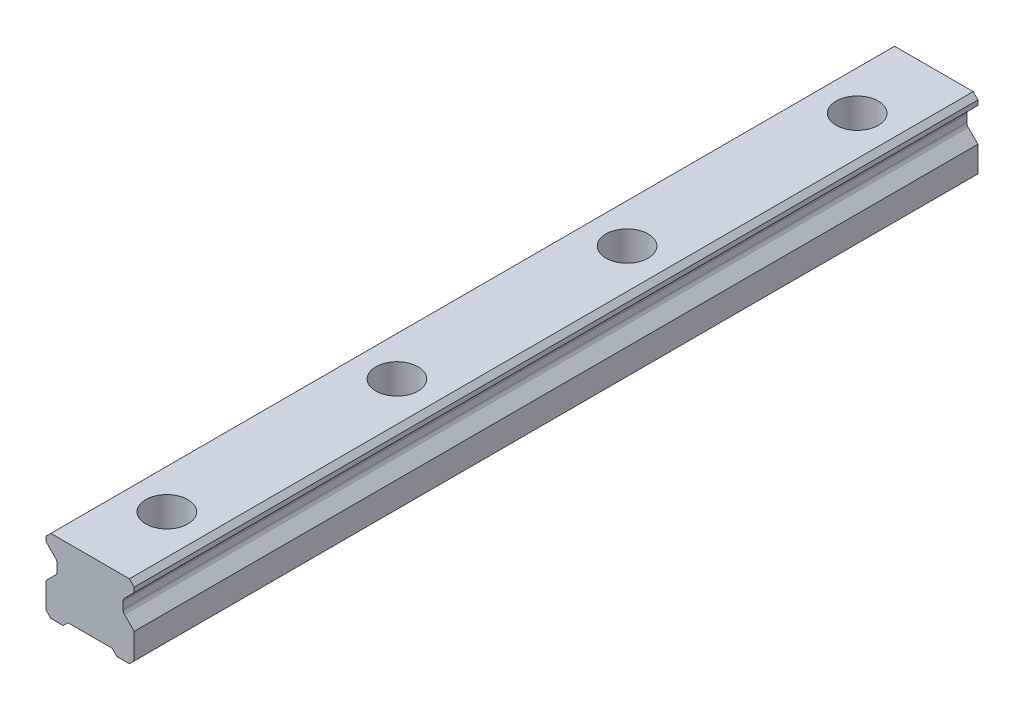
from build123d import *

# Parameters (mm, degrees)
SKETCH1_W           = 23
SKETCH1_H           = 19.2
BOSS_EXTRUDE1_DEPTH = 110
CUT_EXTRUDE1_DEPTH  = 222.135456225
CHAMFER1_SIZE       = 1.25
FILLET1_R           = 1.25
CUT_EXTRUDE2_DEPTH  = 222.135456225
SKETCH4_R           = 5.5
SKETCH4_R_2         = 3.5
CUT_EXTRUDE3_DEPTH  = 9
SKETCH4_2_R         = 3.5
CUT_EXTRUDE4_DEPTH  = 113.253685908
LPATTERN1_COUNT     = 4
LPATTERN1_PITCH     = 60


with BuildPart() as part:
    # Sketch1 → Boss-Extrude1 (new, symmetric)
    with BuildSketch(Plane.XY):
        with Locations((0, 9.6)):
            Rectangle(SKETCH1_W, SKETCH1_H)
    extrude(amount=BOSS_EXTRUDE1_DEPTH, both=True)

    # Sketch2 → Cut-Extrude1 (cut, through all)
    with BuildSketch(Plane.XY.offset(110)):
        Polygon((-11.5, 16.7), (-11.5, 7.95), (-8.583333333, 10.866666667), (-8.583333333, 13.783333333), align=None)
        Polygon((8.583333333, 13.783333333), (11.5, 16.7), (11.5, 7.95), (8.583333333, 10.866666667), align=None)
    extrude(amount=-CUT_EXTRUDE1_DEPTH, mode=Mode.SUBTRACT)

    # Chamfer1
    chamfer1_edges = [part.edges().sort_by_distance(p)[0] for p in [
        (-11.5, 19.2, 0),
        (11.5, 19.2, 0),
        (11.5, 0, 0),
        (-11.5, 0, 0),
    ]]
    chamfer(chamfer1_edges, length=CHAMFER1_SIZE)

    # Fillet1
    fillet1_edges = [part.edges().sort_by_distance(p)[0] for p in [
        (-8.583333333, 13.783333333, 0),
        (-8.583333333, 10.866666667, 0),
        (8.583333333, 10.866666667, 0),
        (8.583333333, 13.783333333, 0),
    ]]
    fillet(fillet1_edges, radius=FILLET1_R)

    # Sketch3 → Cut-Extrude2 (cut, through all)
    with BuildSketch(Plane.XY.offset(110)):
        Polygon((-7, 0), (-5.75, 1.25), (5.75, 1.25), (7, 0), align=None)
    extrude(amount=-CUT_EXTRUDE2_DEPTH, mode=Mode.SUBTRACT)

    # Sketch4 → Cut-Extrude3 (cut)
    with BuildSketch(Plane(origin=(0, 19.2, 0), x_dir=(1, 0, 0), z_dir=(0, 1, 0))):
        with Locations(Location((0, -90, 0), (0, 0, 270))):
            Circle(SKETCH4_R)
        with Locations(Location((0, -90, 0), (0, 0, 270))):
            Circle(SKETCH4_R_2, mode=Mode.SUBTRACT)
    cut_extrude3 = extrude(amount=-CUT_EXTRUDE3_DEPTH, mode=Mode.SUBTRACT)

    # Sketch4_2 → Cut-Extrude4 (cut, through all)
    with BuildSketch(Plane(origin=(0, 19.2, 0), x_dir=(1, 0, 0), z_dir=(0, 1, 0))):
        with Locations(Location((0, -90, 0), (0, 0, 270))):
            Circle(SKETCH4_2_R)
    cut_extrude4 = extrude(amount=-CUT_EXTRUDE4_DEPTH, mode=Mode.SUBTRACT)

    # LPattern1: Cut-Extrude3, Cut-Extrude4 ×4
    with Locations(*[(0, 0, -i * LPATTERN1_PITCH) for i in range(1, LPATTERN1_COUNT)]):
        add(cut_extrude3, mode=Mode.SUBTRACT)
        add(cut_extrude4, mode=Mode.SUBTRACT)


solid = part.part
